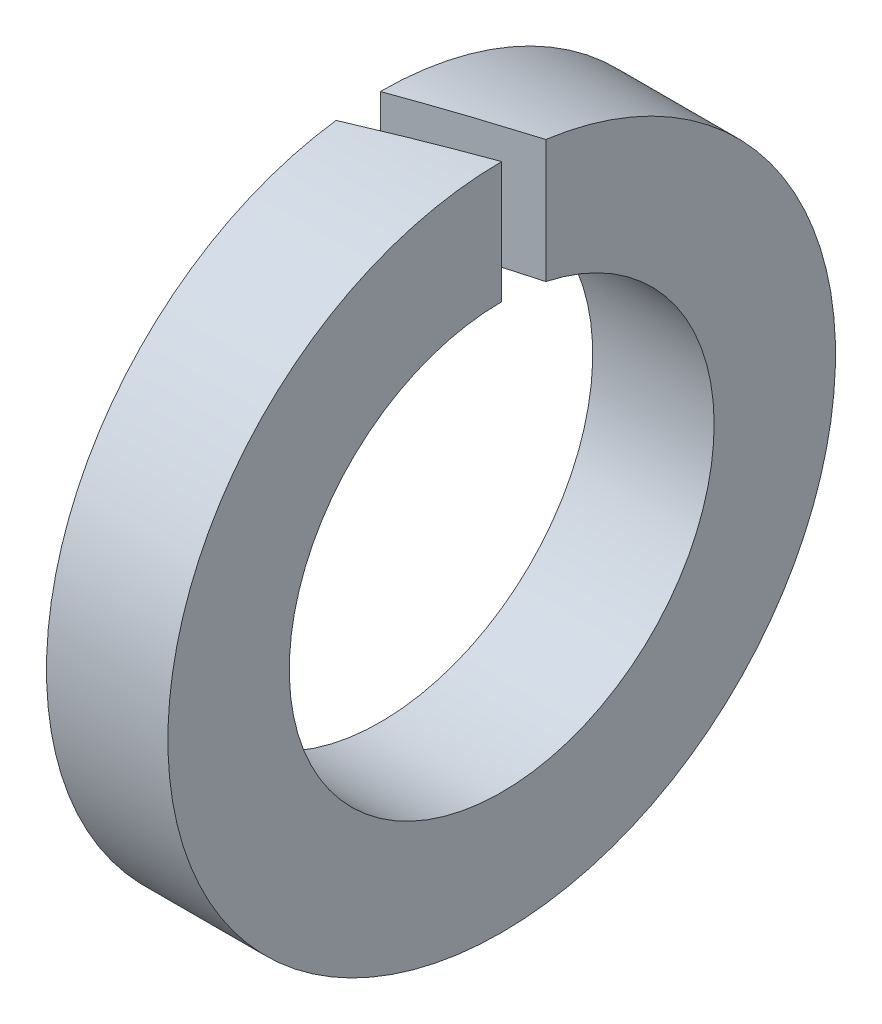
from build123d import *

# Parameters (mm, degrees)
ESQUISSE1_W             = 3
ESQUISSE1_H             = 3
ENL_V_MAT_EXTRU_1_DEPTH = 13.046783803


with BuildPart() as part:
    # Esquisse1 → Base-R_volution (revolve)
    with BuildSketch(Plane(origin=(0, 0, 0), x_dir=(1, 0, 0), z_dir=(0, 1, 0)), mode=Mode.PRIVATE) as base_r_volution_sk:
        with Locations((1.5, 6.75)):
            Rectangle(ESQUISSE1_W, ESQUISSE1_H)
    revolve(base_r_volution_sk.sketch.rotate(Axis((0, 0, 0), (1, 0, 0)), 180), axis=Axis((0, 0, 0), (1, 0, 0)))

    # Esquisse2 → Enl_v. mat.-Extru.1 (cut, through all)
    with BuildSketch(Plane(origin=(0, 0, 0), x_dir=(1, 0, 0), z_dir=(0, 1, 0))):
        Polygon((0, 0), (3, 1.091910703), (3, 0), (0, -1.091910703), align=None)
    extrude(amount=ENL_V_MAT_EXTRU_1_DEPTH, mode=Mode.SUBTRACT)


solid = part.part
